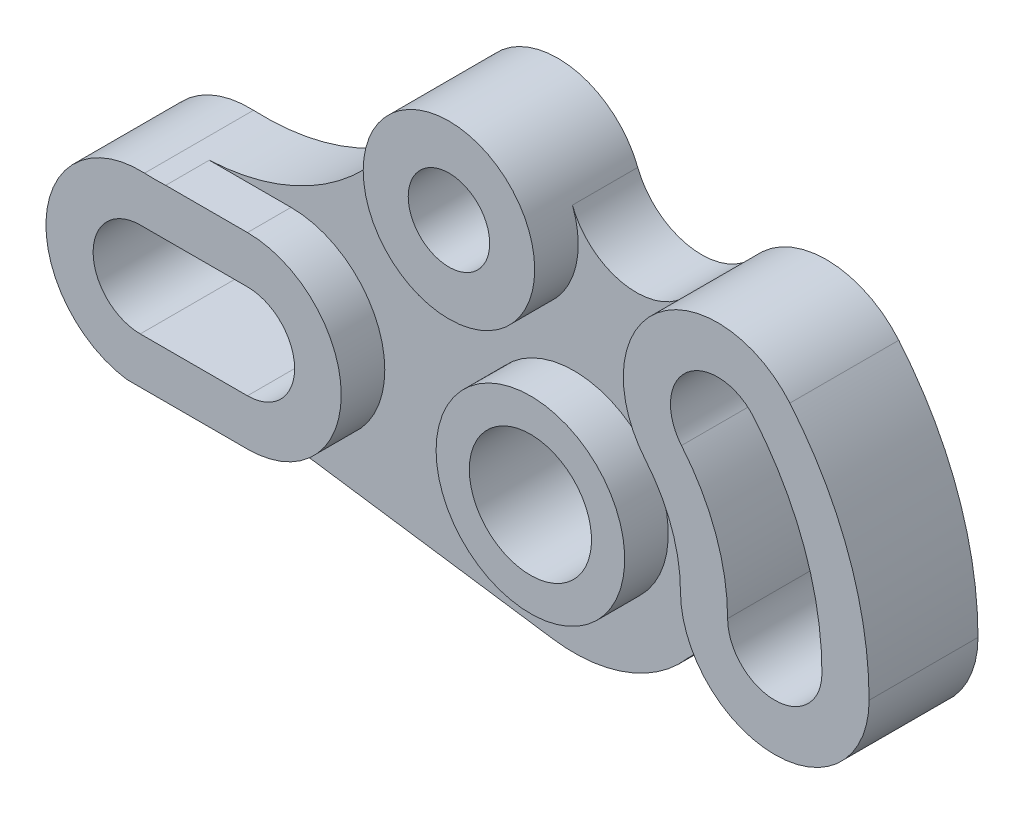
from build123d import *
from build123d.topology import SkipClean

# Parameters (mm, degrees)
SKETCH1_R          = 9.5
SKETCH1_R_2        = 22
SKETCH1_R_3        = 14.25
EXTRUDE1_DEPTH     = 25.4
SKETCH1_6_R        = 22
CUT_EXTRUDE5_DEPTH = 10.16


with BuildPart() as part:
    # Sketch1 → Extrude1 (new body)
    # profile 1 of 5: a face of its own
    with BuildSketch(Plane.XY):
        with BuildLine():
            ThreePointArc((66.56225815, 124.569131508), (43.656107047, 104.668134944), (62.415075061, 80.817714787))
            Line((62.415075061, 80.817714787), (90.557932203, 80.817714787))
            ThreePointArc((90.557932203, 80.817714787), (112.433640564, 102.693423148), (90.557932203, 124.569131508))
            Line((90.557932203, 124.569131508), (71.492585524, 124.569131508))
            ThreePointArc((71.492585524, 124.569131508), (69.027421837, 124.512833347), (66.56225815, 124.569131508))
        make_face()
        with BuildLine():
            Line((65.557932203, 113.592067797), (90.557932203, 113.592067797))
            ThreePointArc((90.557932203, 113.592067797), (101.557932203, 102.592067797), (90.557932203, 91.592067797))
            Line((90.557932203, 91.592067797), (65.557932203, 91.592067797))
            ThreePointArc((65.557932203, 91.592067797), (54.557932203, 102.592067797), (65.557932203, 113.592067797))
        make_face(mode=Mode.SUBTRACT)
    # profile 2 of 5: a face of its own
    with BuildSketch(Plane.XY):
        with BuildLine():
            ThreePointArc((156.196022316, 157.846142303), (137.715128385, 170.591450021), (119.036172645, 158.138220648))
            ThreePointArc((119.036172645, 158.138220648), (133.713142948, 130.965106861), (157.557932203, 150.592067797))
            ThreePointArc((157.557932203, 150.592067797), (157.214506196, 154.282474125), (156.196022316, 157.846142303))
        make_face()
        with Locations(Location((137.557932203, 150.592067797, 0), (0, 0, 180))):
            Circle(SKETCH1_R, mode=Mode.SUBTRACT)
    # profile 3 of 5: a face of its own
    with BuildSketch(Plane.XY):
        with BuildLine():
            Line((90.557932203, 80.817714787), (62.415075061, 80.817714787))
            Line((62.415075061, 80.817714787), (151.557932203, 67.951051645))
            ThreePointArc((151.557932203, 67.951051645), (168.83226838, 69.814931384), (183.081840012, 79.756080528))
            ThreePointArc((183.081840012, 79.756080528), (192.374143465, 85.063981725), (202.933740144, 83.327422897))
            ThreePointArc((202.933740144, 83.327422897), (194.614170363, 91.405741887), (191.557932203, 102.592067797))
            ThreePointArc((191.557932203, 102.592067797), (189.447173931, 114.562772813), (183.369487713, 125.089634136))
            ThreePointArc((183.369487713, 125.089634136), (178.222465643, 139.228131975), (183.36585064, 153.367953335))
            ThreePointArc((183.36585064, 153.367953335), (168.504447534, 147.862402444), (156.196022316, 157.846142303))
            ThreePointArc((156.196022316, 157.846142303), (157.214506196, 154.282474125), (157.557932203, 150.592067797))
            ThreePointArc((157.557932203, 150.592067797), (133.713142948, 130.965106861), (119.036172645, 158.138220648))
            ThreePointArc((119.036172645, 158.138220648), (100.173831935, 134.400463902), (71.492585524, 124.569131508))
            Line((71.492585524, 124.569131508), (90.557932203, 124.569131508))
            ThreePointArc((90.557932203, 124.569131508), (112.433640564, 102.693423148), (90.557932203, 80.817714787))
        make_face()
        with Locations((156.557932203, 102.592067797)):
            Circle(SKETCH1_R_2, mode=Mode.SUBTRACT)
    # profile 4 of 5: a face of its own
    with BuildSketch(Plane.XY):
        with Locations((156.557932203, 102.592067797)):
            Circle(SKETCH1_R_2)
        with Locations(Location((156.557932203, 102.592067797, 0), (0, 0, 180))):
            Circle(SKETCH1_R_3, mode=Mode.SUBTRACT)
    # profile 5 of 5: a face of its own
    with BuildSketch(Plane.XY):
        with BuildLine():
            ThreePointArc((191.557932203, 102.592067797), (194.614170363, 91.405741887), (202.933740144, 83.327422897))
            ThreePointArc((202.933740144, 83.327422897), (224.744258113, 83.648305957), (235.557932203, 102.592067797))
            ThreePointArc((235.557932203, 102.592067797), (230.793649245, 129.611659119), (217.07544321, 153.372288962))
            ThreePointArc((217.07544321, 153.372288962), (200.219635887, 161.230961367), (183.36585064, 153.367953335))
            ThreePointArc((183.36585064, 153.367953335), (178.222465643, 139.228131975), (183.369487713, 125.089634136))
            ThreePointArc((183.369487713, 125.089634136), (189.447173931, 114.562772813), (191.557932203, 102.592067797))
        make_face()
        with BuildLine():
            ThreePointArc((208.648954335, 146.301625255), (220.457030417, 125.849437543), (224.557932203, 102.592067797))
            ThreePointArc((224.557932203, 102.592067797), (213.557932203, 91.592067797), (202.557932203, 102.592067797))
            ThreePointArc((202.557932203, 102.592067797), (199.78379276, 118.32499439), (191.795976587, 132.160297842))
            ThreePointArc((191.795976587, 132.160297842), (193.151801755, 147.657450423), (208.648954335, 146.301625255))
        make_face(mode=Mode.SUBTRACT)
    extrude(amount=-EXTRUDE1_DEPTH)

    # Sketch1_6 → Cut-Extrude5 (cut)
    with SkipClean():  # the faces are left unmerged after this step: merging them gives an invalid solid
        with BuildSketch(Plane.XY):
            with BuildLine():
                Line((90.557932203, 80.817714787), (62.415075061, 80.817714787))
                Line((62.415075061, 80.817714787), (151.557932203, 67.951051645))
                ThreePointArc((151.557932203, 67.951051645), (168.83226838, 69.814931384), (183.081840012, 79.756080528))
                ThreePointArc((183.081840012, 79.756080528), (192.374143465, 85.063981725), (202.933740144, 83.327422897))
                ThreePointArc((202.933740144, 83.327422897), (194.614170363, 91.405741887), (191.557932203, 102.592067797))
                ThreePointArc((191.557932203, 102.592067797), (189.447173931, 114.562772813), (183.369487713, 125.089634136))
                ThreePointArc((183.369487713, 125.089634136), (178.222465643, 139.228131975), (183.36585064, 153.367953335))
                ThreePointArc((183.36585064, 153.367953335), (168.504447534, 147.862402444), (156.196022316, 157.846142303))
                ThreePointArc((156.196022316, 157.846142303), (157.214506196, 154.282474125), (157.557932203, 150.592067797))
                ThreePointArc((157.557932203, 150.592067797), (133.713142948, 130.965106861), (119.036172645, 158.138220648))
                ThreePointArc((119.036172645, 158.138220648), (100.173831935, 134.400463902), (71.492585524, 124.569131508))
                Line((71.492585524, 124.569131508), (90.557932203, 124.569131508))
                ThreePointArc((90.557932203, 124.569131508), (112.433640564, 102.693423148), (90.557932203, 80.817714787))
            make_face()
            with Locations(Location((156.557932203, 102.592067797, 0), (0, 0, 180))):
                Circle(SKETCH1_6_R, mode=Mode.SUBTRACT)
        extrude(amount=-CUT_EXTRUDE5_DEPTH, mode=Mode.SUBTRACT)


solid = part.part
